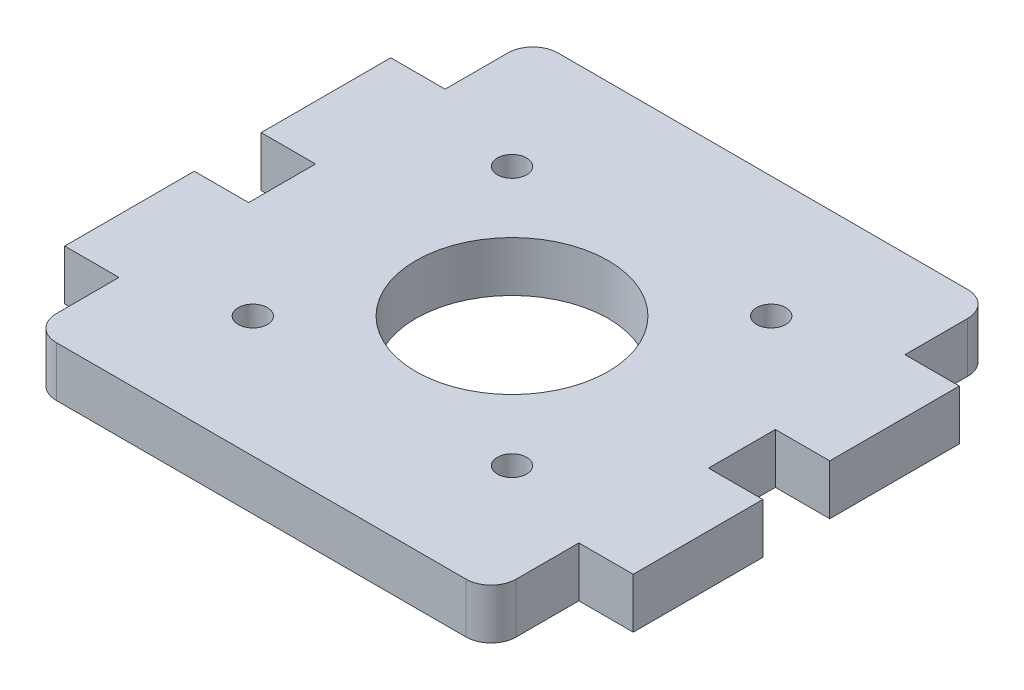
from build123d import *

# Parameters (mm, degrees)
SKETCH1_R           = 11.5
SKETCH1_R_2         = 1.75
BOSS_EXTRUDE1_DEPTH = 3
FILLET1_R           = 3


with BuildPart() as part:
    # Sketch1 → Boss-Extrude1 (new, symmetric)
    with BuildSketch(Plane(origin=(0, 0, 0), x_dir=(1, 0, 0), z_dir=(0, 1, 0))):
        Polygon((-27.5, -30), (27.5, -30), (27.5, -19.5), (34, -19.5), (34, -4), (27.5, -4), (27.5, 4), (34, 4), (34, 19.5), (27.5, 19.5), (27.5, 30), (-27.5, 30), (-27.5, 19.5), (-34, 19.5), (-34, 4), (-27.5, 4), (-27.5, -4), (-34, -4), (-34, -19.5), (-27.5, -19.5), align=None)
        with Locations(Location((0, 0, 0), (0, 0, 270))):
            Circle(SKETCH1_R, mode=Mode.SUBTRACT)
        with Locations(Location((15.5, 15.5, 0), (0, 0, 270))):
            Circle(SKETCH1_R_2, mode=Mode.SUBTRACT)
        with Locations(Location((-15.5, 15.5, 0), (0, 0, 270))):
            Circle(SKETCH1_R_2, mode=Mode.SUBTRACT)
        with Locations(Location((15.5, -15.5, 0), (0, 0, 270))):
            Circle(SKETCH1_R_2, mode=Mode.SUBTRACT)
        with Locations(Location((-15.5, -15.5, 0), (0, 0, 270))):
            Circle(SKETCH1_R_2, mode=Mode.SUBTRACT)
    extrude(amount=BOSS_EXTRUDE1_DEPTH, both=True)

    # Fillet1
    fillet1_edges = [part.edges().sort_by_distance(p)[0] for p in [
        (-27.5, 0, -30),
        (27.5, 0, -30),
        (27.5, 0, 30),
        (-27.5, 0, 30),
    ]]
    fillet(fillet1_edges, radius=FILLET1_R)


solid = part.part
